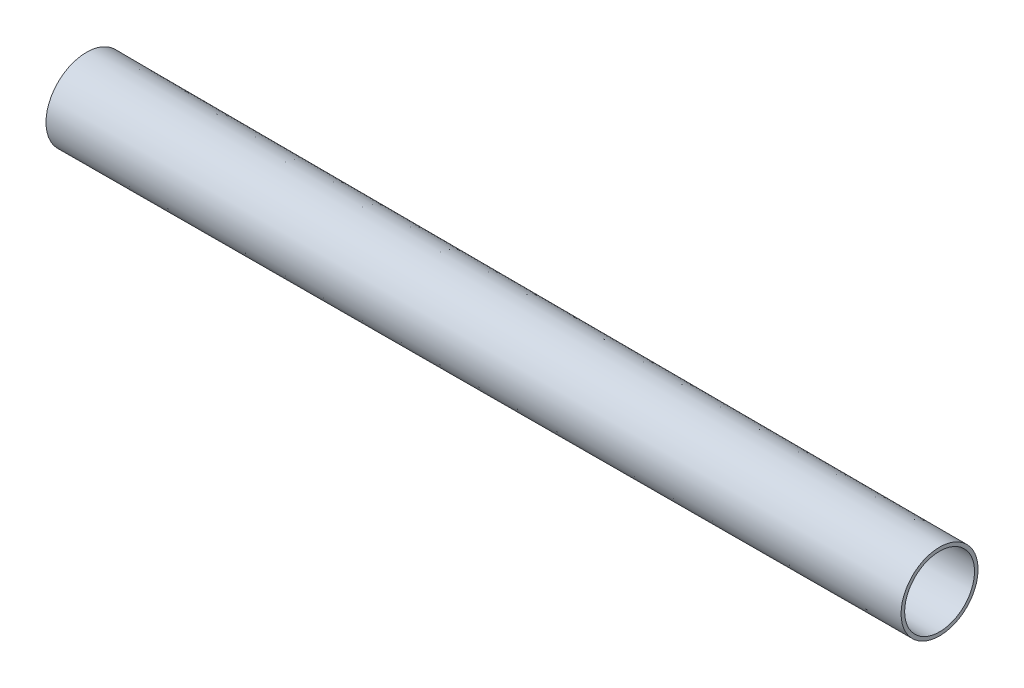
ISO-10303-21;
HEADER;
FILE_DESCRIPTION(('STEP AP214'),'2;1');
FILE_NAME('part.step','',(''),(''),'','','');
FILE_SCHEMA(('AUTOMOTIVE_DESIGN { 1 0 10303 214 1 1 1 1 }'));
ENDSEC;
DATA;
#1=APPLICATION_CONTEXT('core data for automotive mechanical design processes');
#2=APPLICATION_PROTOCOL_DEFINITION('international standard','automotive_design',2000,#1);
#3=PRODUCT_CONTEXT('',#1,'mechanical');
#4=PRODUCT('Part','Part','',(#3));
#5=PRODUCT_RELATED_PRODUCT_CATEGORY('part','',(#4));
#6=PRODUCT_DEFINITION_FORMATION('','',#4);
#7=PRODUCT_DEFINITION_CONTEXT('part definition',#1,'design');
#8=PRODUCT_DEFINITION('design','',#6,#7);
#9=PRODUCT_DEFINITION_SHAPE('','',#8);
#10=(LENGTH_UNIT() NAMED_UNIT(*) SI_UNIT(.MILLI.,.METRE.));
#11=(NAMED_UNIT(*) PLANE_ANGLE_UNIT() SI_UNIT($,.RADIAN.));
#12=(NAMED_UNIT(*) SI_UNIT($,.STERADIAN.) SOLID_ANGLE_UNIT());
#13=UNCERTAINTY_MEASURE_WITH_UNIT(LENGTH_MEASURE(1.E-05),#10,'distance_accuracy_value','');
#14=(GEOMETRIC_REPRESENTATION_CONTEXT(3) GLOBAL_UNCERTAINTY_ASSIGNED_CONTEXT((#13)) GLOBAL_UNIT_ASSIGNED_CONTEXT((#10,
#11,#12)) REPRESENTATION_CONTEXT('',''));
#15=CARTESIAN_POINT('',(0.,0.,0.));
#16=DIRECTION('',(0.,0.,1.));
#17=DIRECTION('',(1.,0.,0.));
#18=AXIS2_PLACEMENT_3D('',#15,#16,#17);
#19=CARTESIAN_POINT('',(34.29,0.,0.));
#20=DIRECTION('',(-1.,0.,0.));
#21=DIRECTION('',(0.,0.,1.));
#22=AXIS2_PLACEMENT_3D('',#19,#20,#21);
#23=CONICAL_SURFACE('',#22,10.4572340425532,0.00238894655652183);
#24=CARTESIAN_POINT('',(275.59,0.,0.));
#25=DIRECTION('',(-1.,0.,0.));
#26=DIRECTION('',(0.,0.,1.));
#27=AXIS2_PLACEMENT_3D('',#24,#25,#26);
#28=CIRCLE('',#27,9.88078014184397);
#29=CARTESIAN_POINT('',(275.59,0.,9.88078014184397));
#30=VERTEX_POINT('',#29);
#31=EDGE_CURVE('E10',#30,#30,#28,.T.);
#32=ORIENTED_EDGE('',*,*,#31,.F.);
#33=EDGE_LOOP('',(#32));
#34=FACE_BOUND('',#33,.T.);
#35=CARTESIAN_POINT('',(34.29,0.,0.));
#36=DIRECTION('',(-1.,0.,0.));
#37=DIRECTION('',(0.,0.,1.));
#38=AXIS2_PLACEMENT_3D('',#35,#36,#37);
#39=CIRCLE('',#38,10.4572340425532);
#40=CARTESIAN_POINT('',(34.29,0.,10.4572340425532));
#41=VERTEX_POINT('',#40);
#42=EDGE_CURVE('E47',#41,#41,#39,.T.);
#43=ORIENTED_EDGE('',*,*,#42,.T.);
#44=EDGE_LOOP('',(#43));
#45=FACE_BOUND('',#44,.T.);
#46=ADVANCED_FACE('F33',(#34,#45),#23,.F.);
#47=CARTESIAN_POINT('',(275.59,9.88078014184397,0.));
#48=DIRECTION('',(-1.,0.,0.));
#49=DIRECTION('',(0.,0.,1.));
#50=AXIS2_PLACEMENT_3D('',#47,#48,#49);
#51=PLANE('',#50);
#52=CARTESIAN_POINT('',(275.59,0.,0.));
#53=DIRECTION('',(-1.,0.,0.));
#54=DIRECTION('',(0.,0.,1.));
#55=AXIS2_PLACEMENT_3D('',#52,#53,#54);
#56=CIRCLE('',#55,10.8895744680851);
#57=CARTESIAN_POINT('',(275.59,0.,10.8895744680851));
#58=VERTEX_POINT('',#57);
#59=EDGE_CURVE('E39',#58,#58,#56,.T.);
#60=ORIENTED_EDGE('',*,*,#59,.F.);
#61=EDGE_LOOP('',(#60));
#62=FACE_BOUND('',#61,.T.);
#63=ORIENTED_EDGE('',*,*,#31,.T.);
#64=EDGE_LOOP('',(#63));
#65=FACE_BOUND('',#64,.T.);
#66=ADVANCED_FACE('F62',(#62,#65),#51,.F.);
#67=CARTESIAN_POINT('',(275.59,0.,0.));
#68=DIRECTION('',(-1.,0.,0.));
#69=DIRECTION('',(0.,0.,1.));
#70=AXIS2_PLACEMENT_3D('',#67,#68,#69);
#71=CONICAL_SURFACE('',#70,10.8895744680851,0.00238894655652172);
#72=CARTESIAN_POINT('',(34.29,0.,0.));
#73=DIRECTION('',(-1.,0.,0.));
#74=DIRECTION('',(0.,0.,1.));
#75=AXIS2_PLACEMENT_3D('',#72,#73,#74);
#76=CIRCLE('',#75,11.4660283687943);
#77=CARTESIAN_POINT('',(34.29,0.,11.4660283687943));
#78=VERTEX_POINT('',#77);
#79=EDGE_CURVE('E43',#78,#78,#76,.T.);
#80=ORIENTED_EDGE('',*,*,#79,.F.);
#81=EDGE_LOOP('',(#80));
#82=FACE_BOUND('',#81,.T.);
#83=ORIENTED_EDGE('',*,*,#59,.T.);
#84=EDGE_LOOP('',(#83));
#85=FACE_BOUND('',#84,.T.);
#86=ADVANCED_FACE('F57',(#82,#85),#71,.T.);
#87=CARTESIAN_POINT('',(34.29,11.4660283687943,0.));
#88=DIRECTION('',(1.,0.,0.));
#89=DIRECTION('',(0.,0.,-1.));
#90=AXIS2_PLACEMENT_3D('',#87,#88,#89);
#91=PLANE('',#90);
#92=ORIENTED_EDGE('',*,*,#42,.F.);
#93=EDGE_LOOP('',(#92));
#94=FACE_BOUND('',#93,.T.);
#95=ORIENTED_EDGE('',*,*,#79,.T.);
#96=EDGE_LOOP('',(#95));
#97=FACE_BOUND('',#96,.T.);
#98=ADVANCED_FACE('F54',(#94,#97),#91,.F.);
#99=CLOSED_SHELL('',(#46,#66,#86,#98));
#100=MANIFOLD_SOLID_BREP('B2',#99);
#101=ADVANCED_BREP_SHAPE_REPRESENTATION('',(#18,#100),#14);
#102=SHAPE_DEFINITION_REPRESENTATION(#9,#101);
ENDSEC;
END-ISO-10303-21;
